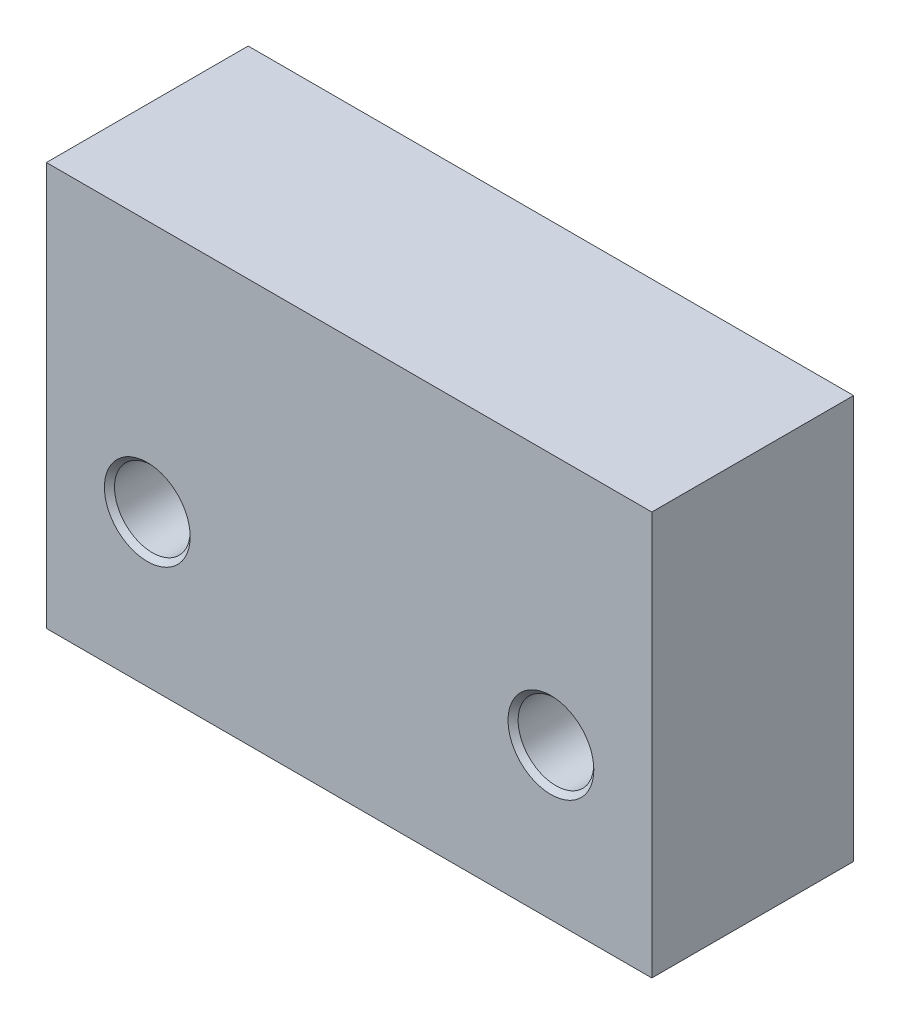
ISO-10303-21;
HEADER;
FILE_DESCRIPTION(('STEP AP214'),'2;1');
FILE_NAME('part.step','',(''),(''),'','','');
FILE_SCHEMA(('AUTOMOTIVE_DESIGN { 1 0 10303 214 1 1 1 1 }'));
ENDSEC;
DATA;
#1=APPLICATION_CONTEXT('core data for automotive mechanical design processes');
#2=APPLICATION_PROTOCOL_DEFINITION('international standard','automotive_design',2000,#1);
#3=PRODUCT_CONTEXT('',#1,'mechanical');
#4=PRODUCT('Part','Part','',(#3));
#5=PRODUCT_RELATED_PRODUCT_CATEGORY('part','',(#4));
#6=PRODUCT_DEFINITION_FORMATION('','',#4);
#7=PRODUCT_DEFINITION_CONTEXT('part definition',#1,'design');
#8=PRODUCT_DEFINITION('design','',#6,#7);
#9=PRODUCT_DEFINITION_SHAPE('','',#8);
#10=(LENGTH_UNIT() NAMED_UNIT(*) SI_UNIT(.MILLI.,.METRE.));
#11=(NAMED_UNIT(*) PLANE_ANGLE_UNIT() SI_UNIT($,.RADIAN.));
#12=(NAMED_UNIT(*) SI_UNIT($,.STERADIAN.) SOLID_ANGLE_UNIT());
#13=UNCERTAINTY_MEASURE_WITH_UNIT(LENGTH_MEASURE(1.E-05),#10,'distance_accuracy_value','');
#14=(GEOMETRIC_REPRESENTATION_CONTEXT(3) GLOBAL_UNCERTAINTY_ASSIGNED_CONTEXT((#13)) GLOBAL_UNIT_ASSIGNED_CONTEXT((#10,
#11,#12)) REPRESENTATION_CONTEXT('',''));
#15=CARTESIAN_POINT('',(0.,0.,0.));
#16=DIRECTION('',(0.,0.,1.));
#17=DIRECTION('',(1.,0.,0.));
#18=AXIS2_PLACEMENT_3D('',#15,#16,#17);
#19=CARTESIAN_POINT('',(-39.4899888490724,21.0733474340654,25.4));
#20=DIRECTION('',(0.,1.,0.));
#21=DIRECTION('',(0.,0.,1.));
#22=AXIS2_PLACEMENT_3D('',#19,#20,#21);
#23=PLANE('',#22);
#24=CARTESIAN_POINT('',(-1.38998884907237,21.0733474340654,12.7));
#25=DIRECTION('',(0.,-1.,0.));
#26=DIRECTION('',(0.,0.,-1.));
#27=AXIS2_PLACEMENT_3D('',#24,#25,#26);
#28=CIRCLE('',#27,7.580376);
#29=CARTESIAN_POINT('',(-1.38998884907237,21.0733474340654,5.119624));
#30=VERTEX_POINT('',#29);
#31=EDGE_CURVE('E108',#30,#30,#28,.T.);
#32=ORIENTED_EDGE('',*,*,#31,.F.);
#33=EDGE_LOOP('',(#32));
#34=FACE_BOUND('',#33,.T.);
#35=DIRECTION('',(1.,0.,0.));
#36=VECTOR('',#35,1.);
#37=CARTESIAN_POINT('',(-39.4899888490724,21.0733474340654,0.));
#38=LINE('',#37,#36);
#39=CARTESIAN_POINT('',(-39.4899888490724,21.0733474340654,0.));
#40=VERTEX_POINT('',#39);
#41=CARTESIAN_POINT('',(36.7207590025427,21.0733474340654,0.));
#42=VERTEX_POINT('',#41);
#43=EDGE_CURVE('E131',#40,#42,#38,.T.);
#44=ORIENTED_EDGE('',*,*,#43,.T.);
#45=DIRECTION('',(0.,0.,-1.));
#46=VECTOR('',#45,1.);
#47=CARTESIAN_POINT('',(36.7207590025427,21.0733474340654,25.4));
#48=LINE('',#47,#46);
#49=CARTESIAN_POINT('',(36.7207590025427,21.0733474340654,25.4));
#50=VERTEX_POINT('',#49);
#51=EDGE_CURVE('E11',#50,#42,#48,.T.);
#52=ORIENTED_EDGE('',*,*,#51,.F.);
#53=DIRECTION('',(1.,0.,0.));
#54=VECTOR('',#53,1.);
#55=CARTESIAN_POINT('',(-39.4899888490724,21.0733474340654,25.4));
#56=LINE('',#55,#54);
#57=CARTESIAN_POINT('',(-39.4899888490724,21.0733474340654,25.4));
#58=VERTEX_POINT('',#57);
#59=EDGE_CURVE('E81',#58,#50,#56,.T.);
#60=ORIENTED_EDGE('',*,*,#59,.F.);
#61=DIRECTION('',(0.,0.,-1.));
#62=VECTOR('',#61,1.);
#63=CARTESIAN_POINT('',(-39.4899888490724,21.0733474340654,25.4));
#64=LINE('',#63,#62);
#65=EDGE_CURVE('E144',#58,#40,#64,.T.);
#66=ORIENTED_EDGE('',*,*,#65,.T.);
#67=EDGE_LOOP('',(#44,#52,#60,#66));
#68=FACE_BOUND('',#67,.T.);
#69=ADVANCED_FACE('F40',(#34,#68),#23,.F.);
#70=CARTESIAN_POINT('',(36.7207590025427,71.8733474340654,25.4));
#71=DIRECTION('',(1.,0.,0.));
#72=DIRECTION('',(0.,1.,0.));
#73=AXIS2_PLACEMENT_3D('',#70,#71,#72);
#74=PLANE('',#73);
#75=DIRECTION('',(0.,-1.,0.));
#76=VECTOR('',#75,1.);
#77=CARTESIAN_POINT('',(36.7207590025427,71.8733474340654,0.));
#78=LINE('',#77,#76);
#79=CARTESIAN_POINT('',(36.7207590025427,71.8733474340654,0.));
#80=VERTEX_POINT('',#79);
#81=EDGE_CURVE('E148',#80,#42,#78,.T.);
#82=ORIENTED_EDGE('',*,*,#81,.F.);
#83=DIRECTION('',(0.,0.,-1.));
#84=VECTOR('',#83,1.);
#85=CARTESIAN_POINT('',(36.7207590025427,71.8733474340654,25.4));
#86=LINE('',#85,#84);
#87=CARTESIAN_POINT('',(36.7207590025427,71.8733474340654,25.4));
#88=VERTEX_POINT('',#87);
#89=EDGE_CURVE('E49',#88,#80,#86,.T.);
#90=ORIENTED_EDGE('',*,*,#89,.F.);
#91=DIRECTION('',(0.,-1.,0.));
#92=VECTOR('',#91,1.);
#93=CARTESIAN_POINT('',(36.7207590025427,71.8733474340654,25.4));
#94=LINE('',#93,#92);
#95=EDGE_CURVE('E134',#88,#50,#94,.T.);
#96=ORIENTED_EDGE('',*,*,#95,.T.);
#97=ORIENTED_EDGE('',*,*,#51,.T.);
#98=EDGE_LOOP('',(#82,#90,#96,#97));
#99=FACE_BOUND('',#98,.T.);
#100=ADVANCED_FACE('F168',(#99),#74,.T.);
#101=CARTESIAN_POINT('',(-39.4899888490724,71.8733474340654,25.4));
#102=DIRECTION('',(0.,1.,0.));
#103=DIRECTION('',(0.,0.,1.));
#104=AXIS2_PLACEMENT_3D('',#101,#102,#103);
#105=PLANE('',#104);
#106=DIRECTION('',(1.,0.,0.));
#107=VECTOR('',#106,1.);
#108=CARTESIAN_POINT('',(-39.4899888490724,71.8733474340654,0.));
#109=LINE('',#108,#107);
#110=CARTESIAN_POINT('',(-39.4899888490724,71.8733474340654,0.));
#111=VERTEX_POINT('',#110);
#112=EDGE_CURVE('E152',#111,#80,#109,.T.);
#113=ORIENTED_EDGE('',*,*,#112,.F.);
#114=DIRECTION('',(0.,0.,-1.));
#115=VECTOR('',#114,1.);
#116=CARTESIAN_POINT('',(-39.4899888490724,71.8733474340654,25.4));
#117=LINE('',#116,#115);
#118=CARTESIAN_POINT('',(-39.4899888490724,71.8733474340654,25.4));
#119=VERTEX_POINT('',#118);
#120=EDGE_CURVE('E73',#119,#111,#117,.T.);
#121=ORIENTED_EDGE('',*,*,#120,.F.);
#122=DIRECTION('',(1.,0.,0.));
#123=VECTOR('',#122,1.);
#124=CARTESIAN_POINT('',(-39.4899888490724,71.8733474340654,25.4));
#125=LINE('',#124,#123);
#126=EDGE_CURVE('E138',#119,#88,#125,.T.);
#127=ORIENTED_EDGE('',*,*,#126,.T.);
#128=ORIENTED_EDGE('',*,*,#89,.T.);
#129=EDGE_LOOP('',(#113,#121,#127,#128));
#130=FACE_BOUND('',#129,.T.);
#131=ADVANCED_FACE('F166',(#130),#105,.T.);
#132=CARTESIAN_POINT('',(-39.4899888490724,71.8733474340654,25.4));
#133=DIRECTION('',(1.,0.,0.));
#134=DIRECTION('',(0.,0.,-1.));
#135=AXIS2_PLACEMENT_3D('',#132,#133,#134);
#136=PLANE('',#135);
#137=DIRECTION('',(0.,-1.,0.));
#138=VECTOR('',#137,1.);
#139=CARTESIAN_POINT('',(-39.4899888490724,71.8733474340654,0.));
#140=LINE('',#139,#138);
#141=EDGE_CURVE('E76',#111,#40,#140,.T.);
#142=ORIENTED_EDGE('',*,*,#141,.T.);
#143=ORIENTED_EDGE('',*,*,#65,.F.);
#144=DIRECTION('',(0.,-1.,0.));
#145=VECTOR('',#144,1.);
#146=CARTESIAN_POINT('',(-39.4899888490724,71.8733474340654,25.4));
#147=LINE('',#146,#145);
#148=EDGE_CURVE('E57',#119,#58,#147,.T.);
#149=ORIENTED_EDGE('',*,*,#148,.F.);
#150=ORIENTED_EDGE('',*,*,#120,.T.);
#151=EDGE_LOOP('',(#142,#143,#149,#150));
#152=FACE_BOUND('',#151,.T.);
#153=ADVANCED_FACE('F173',(#152),#136,.F.);
#154=CARTESIAN_POINT('',(0.,0.,25.4));
#155=DIRECTION('',(0.,0.,-1.));
#156=DIRECTION('',(-1.,0.,0.));
#157=AXIS2_PLACEMENT_3D('',#154,#155,#156);
#158=PLANE('',#157);
#159=CARTESIAN_POINT('',(24.0207590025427,40.1233474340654,25.4));
#160=DIRECTION('',(0.,0.,1.));
#161=DIRECTION('',(1.,0.,0.));
#162=AXIS2_PLACEMENT_3D('',#159,#160,#161);
#163=CIRCLE('',#162,5.3975);
#164=CARTESIAN_POINT('',(29.4182590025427,40.1233474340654,25.4));
#165=VERTEX_POINT('',#164);
#166=EDGE_CURVE('E98',#165,#165,#163,.T.);
#167=ORIENTED_EDGE('',*,*,#166,.F.);
#168=EDGE_LOOP('',(#167));
#169=FACE_BOUND('',#168,.T.);
#170=CARTESIAN_POINT('',(-26.7899888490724,40.1233474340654,25.4));
#171=DIRECTION('',(0.,0.,1.));
#172=DIRECTION('',(1.,0.,0.));
#173=AXIS2_PLACEMENT_3D('',#170,#171,#172);
#174=CIRCLE('',#173,5.3975);
#175=CARTESIAN_POINT('',(-21.3924888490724,40.1233474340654,25.4));
#176=VERTEX_POINT('',#175);
#177=EDGE_CURVE('E119',#176,#176,#174,.T.);
#178=ORIENTED_EDGE('',*,*,#177,.F.);
#179=EDGE_LOOP('',(#178));
#180=FACE_BOUND('',#179,.T.);
#181=ORIENTED_EDGE('',*,*,#59,.T.);
#182=ORIENTED_EDGE('',*,*,#95,.F.);
#183=ORIENTED_EDGE('',*,*,#126,.F.);
#184=ORIENTED_EDGE('',*,*,#148,.T.);
#185=EDGE_LOOP('',(#181,#182,#183,#184));
#186=FACE_BOUND('',#185,.T.);
#187=ADVANCED_FACE('F174',(#169,#180,#186),#158,.F.);
#188=CARTESIAN_POINT('',(0.,0.,0.));
#189=DIRECTION('',(0.,0.,-1.));
#190=DIRECTION('',(-1.,0.,0.));
#191=AXIS2_PLACEMENT_3D('',#188,#189,#190);
#192=PLANE('',#191);
#193=CARTESIAN_POINT('',(24.0207590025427,40.1233474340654,0.));
#194=DIRECTION('',(0.,0.,1.));
#195=DIRECTION('',(1.,0.,0.));
#196=AXIS2_PLACEMENT_3D('',#193,#194,#195);
#197=CIRCLE('',#196,4.7625);
#198=CARTESIAN_POINT('',(28.7832590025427,40.1233474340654,0.));
#199=VERTEX_POINT('',#198);
#200=EDGE_CURVE('E115',#199,#199,#197,.T.);
#201=ORIENTED_EDGE('',*,*,#200,.T.);
#202=EDGE_LOOP('',(#201));
#203=FACE_BOUND('',#202,.T.);
#204=CARTESIAN_POINT('',(-26.7899888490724,40.1233474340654,0.));
#205=DIRECTION('',(0.,0.,1.));
#206=DIRECTION('',(1.,0.,0.));
#207=AXIS2_PLACEMENT_3D('',#204,#205,#206);
#208=CIRCLE('',#207,4.7625);
#209=CARTESIAN_POINT('',(-22.0274888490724,40.1233474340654,0.));
#210=VERTEX_POINT('',#209);
#211=EDGE_CURVE('E127',#210,#210,#208,.T.);
#212=ORIENTED_EDGE('',*,*,#211,.T.);
#213=EDGE_LOOP('',(#212));
#214=FACE_BOUND('',#213,.T.);
#215=ORIENTED_EDGE('',*,*,#43,.F.);
#216=ORIENTED_EDGE('',*,*,#141,.F.);
#217=ORIENTED_EDGE('',*,*,#112,.T.);
#218=ORIENTED_EDGE('',*,*,#81,.T.);
#219=EDGE_LOOP('',(#215,#216,#217,#218));
#220=FACE_BOUND('',#219,.T.);
#221=ADVANCED_FACE('F171',(#203,#214,#220),#192,.T.);
#222=CARTESIAN_POINT('',(-26.7899888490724,40.1233474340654,25.4));
#223=DIRECTION('',(0.,0.,1.));
#224=DIRECTION('',(1.,0.,0.));
#225=AXIS2_PLACEMENT_3D('',#222,#223,#224);
#226=CYLINDRICAL_SURFACE('',#225,4.7625);
#227=ORIENTED_EDGE('',*,*,#211,.F.);
#228=EDGE_LOOP('',(#227));
#229=FACE_BOUND('',#228,.T.);
#230=CARTESIAN_POINT('',(-26.7899888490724,40.1233474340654,24.765));
#231=DIRECTION('',(0.,0.,1.));
#232=DIRECTION('',(1.,0.,0.));
#233=AXIS2_PLACEMENT_3D('',#230,#231,#232);
#234=CIRCLE('',#233,4.7625);
#235=CARTESIAN_POINT('',(-22.0274888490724,40.1233474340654,24.765));
#236=VERTEX_POINT('',#235);
#237=EDGE_CURVE('E123',#236,#236,#234,.T.);
#238=ORIENTED_EDGE('',*,*,#237,.T.);
#239=EDGE_LOOP('',(#238));
#240=FACE_BOUND('',#239,.T.);
#241=ADVANCED_FACE('F182',(#229,#240),#226,.F.);
#242=CARTESIAN_POINT('',(-26.7899888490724,40.1233474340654,25.4));
#243=DIRECTION('',(0.,0.,1.));
#244=DIRECTION('',(1.,0.,0.));
#245=AXIS2_PLACEMENT_3D('',#242,#243,#244);
#246=CONICAL_SURFACE('',#245,5.3975,0.785398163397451);
#247=ORIENTED_EDGE('',*,*,#237,.F.);
#248=EDGE_LOOP('',(#247));
#249=FACE_BOUND('',#248,.T.);
#250=ORIENTED_EDGE('',*,*,#177,.T.);
#251=EDGE_LOOP('',(#250));
#252=FACE_BOUND('',#251,.T.);
#253=ADVANCED_FACE('F216',(#249,#252),#246,.F.);
#254=CARTESIAN_POINT('',(24.0207590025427,40.1233474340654,25.4));
#255=DIRECTION('',(0.,0.,1.));
#256=DIRECTION('',(1.,0.,0.));
#257=AXIS2_PLACEMENT_3D('',#254,#255,#256);
#258=CYLINDRICAL_SURFACE('',#257,4.7625);
#259=ORIENTED_EDGE('',*,*,#200,.F.);
#260=EDGE_LOOP('',(#259));
#261=FACE_BOUND('',#260,.T.);
#262=CARTESIAN_POINT('',(24.0207590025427,40.1233474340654,24.765));
#263=DIRECTION('',(0.,0.,1.));
#264=DIRECTION('',(1.,0.,0.));
#265=AXIS2_PLACEMENT_3D('',#262,#263,#264);
#266=CIRCLE('',#265,4.7625);
#267=CARTESIAN_POINT('',(28.7832590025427,40.1233474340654,24.765));
#268=VERTEX_POINT('',#267);
#269=EDGE_CURVE('E105',#268,#268,#266,.T.);
#270=ORIENTED_EDGE('',*,*,#269,.T.);
#271=EDGE_LOOP('',(#270));
#272=FACE_BOUND('',#271,.T.);
#273=ADVANCED_FACE('F212',(#261,#272),#258,.F.);
#274=CARTESIAN_POINT('',(24.0207590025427,40.1233474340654,25.4));
#275=DIRECTION('',(0.,0.,1.));
#276=DIRECTION('',(1.,0.,0.));
#277=AXIS2_PLACEMENT_3D('',#274,#275,#276);
#278=CONICAL_SURFACE('',#277,5.3975,0.785398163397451);
#279=ORIENTED_EDGE('',*,*,#269,.F.);
#280=EDGE_LOOP('',(#279));
#281=FACE_BOUND('',#280,.T.);
#282=ORIENTED_EDGE('',*,*,#166,.T.);
#283=EDGE_LOOP('',(#282));
#284=FACE_BOUND('',#283,.T.);
#285=ADVANCED_FACE('F91',(#281,#284),#278,.F.);
#286=CARTESIAN_POINT('',(-1.38998884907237,46.4733474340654,12.7));
#287=DIRECTION('',(0.,-1.,0.));
#288=DIRECTION('',(0.,0.,-1.));
#289=AXIS2_PLACEMENT_3D('',#286,#287,#288);
#290=CONICAL_SURFACE('',#289,6.94537599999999,1.02974425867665);
#291=CARTESIAN_POINT('',(-1.38998884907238,50.6465503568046,12.7));
#292=VERTEX_POINT('',#291);
#293=VERTEX_LOOP('',#292);
#294=FACE_BOUND('',#293,.T.);
#295=CARTESIAN_POINT('',(-1.38998884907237,46.4733474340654,12.7));
#296=DIRECTION('',(0.,-1.,0.));
#297=DIRECTION('',(0.,0.,-1.));
#298=AXIS2_PLACEMENT_3D('',#295,#296,#297);
#299=CIRCLE('',#298,6.94537599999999);
#300=CARTESIAN_POINT('',(-1.38998884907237,46.4733474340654,5.75462400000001));
#301=VERTEX_POINT('',#300);
#302=EDGE_CURVE('E95',#301,#301,#299,.T.);
#303=ORIENTED_EDGE('',*,*,#302,.T.);
#304=EDGE_LOOP('',(#303));
#305=FACE_BOUND('',#304,.T.);
#306=ADVANCED_FACE('F87',(#294,#305),#290,.F.);
#307=CARTESIAN_POINT('',(-1.38998884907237,21.0733474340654,12.7));
#308=DIRECTION('',(0.,-1.,0.));
#309=DIRECTION('',(0.,0.,-1.));
#310=AXIS2_PLACEMENT_3D('',#307,#308,#309);
#311=CYLINDRICAL_SURFACE('',#310,6.945376);
#312=ORIENTED_EDGE('',*,*,#302,.F.);
#313=EDGE_LOOP('',(#312));
#314=FACE_BOUND('',#313,.T.);
#315=CARTESIAN_POINT('',(-1.38998884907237,21.7083474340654,12.7));
#316=DIRECTION('',(0.,-1.,0.));
#317=DIRECTION('',(0.,0.,-1.));
#318=AXIS2_PLACEMENT_3D('',#315,#316,#317);
#319=CIRCLE('',#318,6.945376);
#320=CARTESIAN_POINT('',(-1.38998884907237,21.7083474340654,5.754624));
#321=VERTEX_POINT('',#320);
#322=EDGE_CURVE('E99',#321,#321,#319,.T.);
#323=ORIENTED_EDGE('',*,*,#322,.T.);
#324=EDGE_LOOP('',(#323));
#325=FACE_BOUND('',#324,.T.);
#326=ADVANCED_FACE('F90',(#314,#325),#311,.F.);
#327=CARTESIAN_POINT('',(-1.38998884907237,21.0733474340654,12.7));
#328=DIRECTION('',(0.,-1.,0.));
#329=DIRECTION('',(0.,0.,-1.));
#330=AXIS2_PLACEMENT_3D('',#327,#328,#329);
#331=CONICAL_SURFACE('',#330,7.580376,0.785398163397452);
#332=ORIENTED_EDGE('',*,*,#322,.F.);
#333=EDGE_LOOP('',(#332));
#334=FACE_BOUND('',#333,.T.);
#335=ORIENTED_EDGE('',*,*,#31,.T.);
#336=EDGE_LOOP('',(#335));
#337=FACE_BOUND('',#336,.T.);
#338=ADVANCED_FACE('F200',(#334,#337),#331,.F.);
#339=CLOSED_SHELL('',(#69,#100,#131,#153,#187,#221,#241,#253,#273,#285,#306,#326,#338));
#340=MANIFOLD_SOLID_BREP('B2',#339);
#341=ADVANCED_BREP_SHAPE_REPRESENTATION('',(#18,#340),#14);
#342=SHAPE_DEFINITION_REPRESENTATION(#9,#341);
ENDSEC;
END-ISO-10303-21;
